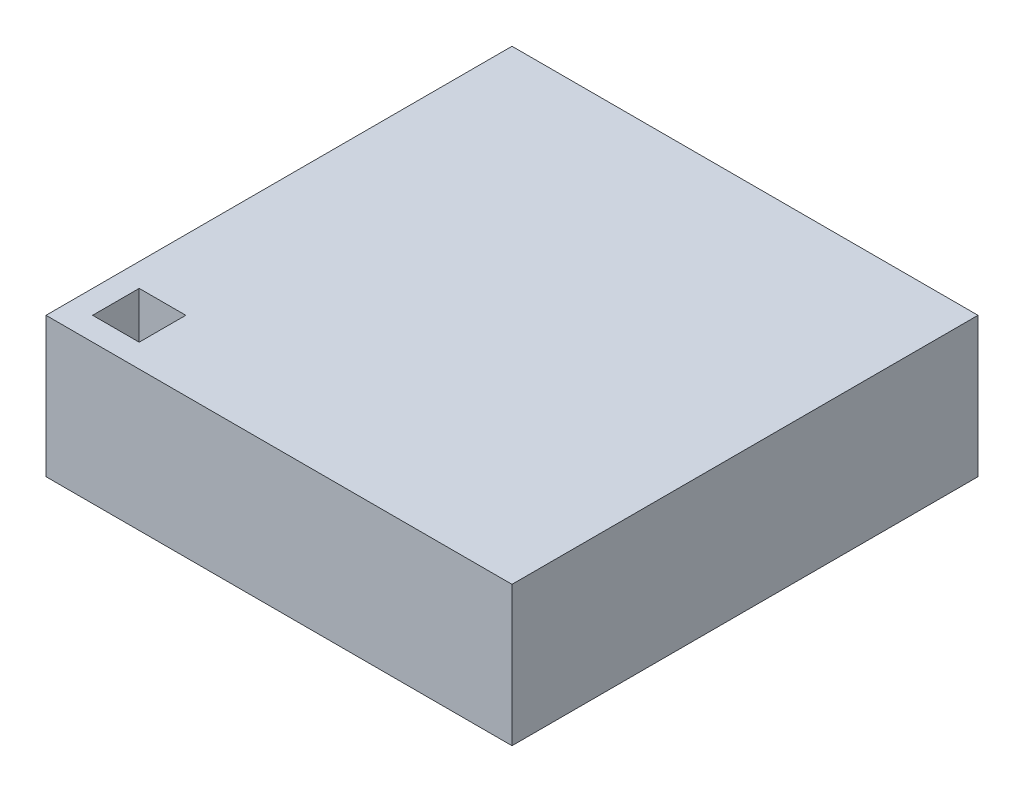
ISO-10303-21;
HEADER;
FILE_DESCRIPTION(('STEP AP214'),'2;1');
FILE_NAME('part.step','',(''),(''),'','','');
FILE_SCHEMA(('AUTOMOTIVE_DESIGN { 1 0 10303 214 1 1 1 1 }'));
ENDSEC;
DATA;
#1=APPLICATION_CONTEXT('core data for automotive mechanical design processes');
#2=APPLICATION_PROTOCOL_DEFINITION('international standard','automotive_design',2000,#1);
#3=PRODUCT_CONTEXT('',#1,'mechanical');
#4=PRODUCT('Part','Part','',(#3));
#5=PRODUCT_RELATED_PRODUCT_CATEGORY('part','',(#4));
#6=PRODUCT_DEFINITION_FORMATION('','',#4);
#7=PRODUCT_DEFINITION_CONTEXT('part definition',#1,'design');
#8=PRODUCT_DEFINITION('design','',#6,#7);
#9=PRODUCT_DEFINITION_SHAPE('','',#8);
#10=(LENGTH_UNIT() NAMED_UNIT(*) SI_UNIT(.MILLI.,.METRE.));
#11=(NAMED_UNIT(*) PLANE_ANGLE_UNIT() SI_UNIT($,.RADIAN.));
#12=(NAMED_UNIT(*) SI_UNIT($,.STERADIAN.) SOLID_ANGLE_UNIT());
#13=UNCERTAINTY_MEASURE_WITH_UNIT(LENGTH_MEASURE(1.E-05),#10,'distance_accuracy_value','');
#14=(GEOMETRIC_REPRESENTATION_CONTEXT(3) GLOBAL_UNCERTAINTY_ASSIGNED_CONTEXT((#13)) GLOBAL_UNIT_ASSIGNED_CONTEXT((#10,
#11,#12)) REPRESENTATION_CONTEXT('',''));
#15=CARTESIAN_POINT('',(0.,0.,0.));
#16=DIRECTION('',(0.,0.,1.));
#17=DIRECTION('',(1.,0.,0.));
#18=AXIS2_PLACEMENT_3D('',#15,#16,#17);
#19=CARTESIAN_POINT('',(-50.,30.,-50.));
#20=DIRECTION('',(1.,0.,0.));
#21=DIRECTION('',(0.,0.,-1.));
#22=AXIS2_PLACEMENT_3D('',#19,#20,#21);
#23=PLANE('',#22);
#24=DIRECTION('',(0.,0.,1.));
#25=VECTOR('',#24,1.);
#26=CARTESIAN_POINT('',(-50.,0.,-50.));
#27=LINE('',#26,#25);
#28=CARTESIAN_POINT('',(-50.,0.,-50.));
#29=VERTEX_POINT('',#28);
#30=CARTESIAN_POINT('',(-50.,0.,50.));
#31=VERTEX_POINT('',#30);
#32=EDGE_CURVE('E129',#29,#31,#27,.T.);
#33=ORIENTED_EDGE('',*,*,#32,.T.);
#34=DIRECTION('',(0.,-1.,0.));
#35=VECTOR('',#34,1.);
#36=CARTESIAN_POINT('',(-50.,30.,50.));
#37=LINE('',#36,#35);
#38=CARTESIAN_POINT('',(-50.,30.,50.));
#39=VERTEX_POINT('',#38);
#40=EDGE_CURVE('E11',#39,#31,#37,.T.);
#41=ORIENTED_EDGE('',*,*,#40,.F.);
#42=DIRECTION('',(0.,0.,1.));
#43=VECTOR('',#42,1.);
#44=CARTESIAN_POINT('',(-50.,30.,-50.));
#45=LINE('',#44,#43);
#46=CARTESIAN_POINT('',(-50.,30.,-50.));
#47=VERTEX_POINT('',#46);
#48=EDGE_CURVE('E141',#47,#39,#45,.T.);
#49=ORIENTED_EDGE('',*,*,#48,.F.);
#50=DIRECTION('',(0.,-1.,0.));
#51=VECTOR('',#50,1.);
#52=CARTESIAN_POINT('',(-50.,30.,-50.));
#53=LINE('',#52,#51);
#54=EDGE_CURVE('E150',#47,#29,#53,.T.);
#55=ORIENTED_EDGE('',*,*,#54,.T.);
#56=EDGE_LOOP('',(#33,#41,#49,#55));
#57=FACE_BOUND('',#56,.T.);
#58=ADVANCED_FACE('F32',(#57),#23,.F.);
#59=CARTESIAN_POINT('',(-50.,30.,50.));
#60=DIRECTION('',(0.,0.,-1.));
#61=DIRECTION('',(-1.,0.,0.));
#62=AXIS2_PLACEMENT_3D('',#59,#60,#61);
#63=PLANE('',#62);
#64=DIRECTION('',(1.,0.,0.));
#65=VECTOR('',#64,1.);
#66=CARTESIAN_POINT('',(-50.,0.,50.));
#67=LINE('',#66,#65);
#68=CARTESIAN_POINT('',(50.,0.,50.));
#69=VERTEX_POINT('',#68);
#70=EDGE_CURVE('E135',#31,#69,#67,.T.);
#71=ORIENTED_EDGE('',*,*,#70,.T.);
#72=DIRECTION('',(0.,-1.,0.));
#73=VECTOR('',#72,1.);
#74=CARTESIAN_POINT('',(50.,30.,50.));
#75=LINE('',#74,#73);
#76=CARTESIAN_POINT('',(50.,30.,50.));
#77=VERTEX_POINT('',#76);
#78=EDGE_CURVE('E39',#77,#69,#75,.T.);
#79=ORIENTED_EDGE('',*,*,#78,.F.);
#80=DIRECTION('',(1.,0.,0.));
#81=VECTOR('',#80,1.);
#82=CARTESIAN_POINT('',(-50.,30.,50.));
#83=LINE('',#82,#81);
#84=EDGE_CURVE('E144',#39,#77,#83,.T.);
#85=ORIENTED_EDGE('',*,*,#84,.F.);
#86=ORIENTED_EDGE('',*,*,#40,.T.);
#87=EDGE_LOOP('',(#71,#79,#85,#86));
#88=FACE_BOUND('',#87,.T.);
#89=ADVANCED_FACE('F174',(#88),#63,.F.);
#90=CARTESIAN_POINT('',(50.,30.,-50.));
#91=DIRECTION('',(-1.,0.,0.));
#92=DIRECTION('',(0.,0.,1.));
#93=AXIS2_PLACEMENT_3D('',#90,#91,#92);
#94=PLANE('',#93);
#95=DIRECTION('',(0.,0.,-1.));
#96=VECTOR('',#95,1.);
#97=CARTESIAN_POINT('',(50.,0.,-50.));
#98=LINE('',#97,#96);
#99=CARTESIAN_POINT('',(50.,0.,-50.));
#100=VERTEX_POINT('',#99);
#101=EDGE_CURVE('E137',#69,#100,#98,.T.);
#102=ORIENTED_EDGE('',*,*,#101,.T.);
#103=DIRECTION('',(0.,-1.,0.));
#104=VECTOR('',#103,1.);
#105=CARTESIAN_POINT('',(50.,30.,-50.));
#106=LINE('',#105,#104);
#107=CARTESIAN_POINT('',(50.,30.,-50.));
#108=VERTEX_POINT('',#107);
#109=EDGE_CURVE('E153',#108,#100,#106,.T.);
#110=ORIENTED_EDGE('',*,*,#109,.F.);
#111=DIRECTION('',(0.,0.,-1.));
#112=VECTOR('',#111,1.);
#113=CARTESIAN_POINT('',(50.,30.,-50.));
#114=LINE('',#113,#112);
#115=EDGE_CURVE('E146',#77,#108,#114,.T.);
#116=ORIENTED_EDGE('',*,*,#115,.F.);
#117=ORIENTED_EDGE('',*,*,#78,.T.);
#118=EDGE_LOOP('',(#102,#110,#116,#117));
#119=FACE_BOUND('',#118,.T.);
#120=ADVANCED_FACE('F160',(#119),#94,.F.);
#121=CARTESIAN_POINT('',(-50.,30.,-50.));
#122=DIRECTION('',(0.,0.,1.));
#123=DIRECTION('',(1.,0.,0.));
#124=AXIS2_PLACEMENT_3D('',#121,#122,#123);
#125=PLANE('',#124);
#126=DIRECTION('',(-1.,0.,0.));
#127=VECTOR('',#126,1.);
#128=CARTESIAN_POINT('',(-50.,0.,-50.));
#129=LINE('',#128,#127);
#130=EDGE_CURVE('E139',#100,#29,#129,.T.);
#131=ORIENTED_EDGE('',*,*,#130,.T.);
#132=ORIENTED_EDGE('',*,*,#54,.F.);
#133=DIRECTION('',(-1.,0.,0.));
#134=VECTOR('',#133,1.);
#135=CARTESIAN_POINT('',(-50.,30.,-50.));
#136=LINE('',#135,#134);
#137=EDGE_CURVE('E148',#108,#47,#136,.T.);
#138=ORIENTED_EDGE('',*,*,#137,.F.);
#139=ORIENTED_EDGE('',*,*,#109,.T.);
#140=EDGE_LOOP('',(#131,#132,#138,#139));
#141=FACE_BOUND('',#140,.T.);
#142=ADVANCED_FACE('F167',(#141),#125,.F.);
#143=CARTESIAN_POINT('',(-50.,30.,50.));
#144=DIRECTION('',(0.,1.,0.));
#145=DIRECTION('',(0.,0.,1.));
#146=AXIS2_PLACEMENT_3D('',#143,#144,#145);
#147=PLANE('',#146);
#148=DIRECTION('',(0.,0.,1.));
#149=VECTOR('',#148,1.);
#150=CARTESIAN_POINT('',(-45.,30.,45.));
#151=LINE('',#150,#149);
#152=CARTESIAN_POINT('',(-45.,30.,35.));
#153=VERTEX_POINT('',#152);
#154=CARTESIAN_POINT('',(-45.,30.,45.));
#155=VERTEX_POINT('',#154);
#156=EDGE_CURVE('E46',#153,#155,#151,.T.);
#157=ORIENTED_EDGE('',*,*,#156,.F.);
#158=DIRECTION('',(-1.,0.,0.));
#159=VECTOR('',#158,1.);
#160=CARTESIAN_POINT('',(-45.,30.,35.));
#161=LINE('',#160,#159);
#162=CARTESIAN_POINT('',(-35.,30.,35.));
#163=VERTEX_POINT('',#162);
#164=EDGE_CURVE('E114',#163,#153,#161,.T.);
#165=ORIENTED_EDGE('',*,*,#164,.F.);
#166=DIRECTION('',(0.,0.,-1.));
#167=VECTOR('',#166,1.);
#168=CARTESIAN_POINT('',(-35.,30.,45.));
#169=LINE('',#168,#167);
#170=CARTESIAN_POINT('',(-35.,30.,45.));
#171=VERTEX_POINT('',#170);
#172=EDGE_CURVE('E117',#171,#163,#169,.T.);
#173=ORIENTED_EDGE('',*,*,#172,.F.);
#174=DIRECTION('',(1.,0.,0.));
#175=VECTOR('',#174,1.);
#176=CARTESIAN_POINT('',(-45.,30.,45.));
#177=LINE('',#176,#175);
#178=EDGE_CURVE('E123',#155,#171,#177,.T.);
#179=ORIENTED_EDGE('',*,*,#178,.F.);
#180=EDGE_LOOP('',(#157,#165,#173,#179));
#181=FACE_BOUND('',#180,.T.);
#182=ORIENTED_EDGE('',*,*,#48,.T.);
#183=ORIENTED_EDGE('',*,*,#84,.T.);
#184=ORIENTED_EDGE('',*,*,#115,.T.);
#185=ORIENTED_EDGE('',*,*,#137,.T.);
#186=EDGE_LOOP('',(#182,#183,#184,#185));
#187=FACE_BOUND('',#186,.T.);
#188=ADVANCED_FACE('F173',(#181,#187),#147,.T.);
#189=CARTESIAN_POINT('',(-50.,0.,50.));
#190=DIRECTION('',(0.,1.,0.));
#191=DIRECTION('',(0.,0.,1.));
#192=AXIS2_PLACEMENT_3D('',#189,#190,#191);
#193=PLANE('',#192);
#194=DIRECTION('',(-1.,0.,0.));
#195=VECTOR('',#194,1.);
#196=CARTESIAN_POINT('',(-45.,0.,35.));
#197=LINE('',#196,#195);
#198=CARTESIAN_POINT('',(-35.,0.,35.));
#199=VERTEX_POINT('',#198);
#200=CARTESIAN_POINT('',(-45.,0.,35.));
#201=VERTEX_POINT('',#200);
#202=EDGE_CURVE('E104',#199,#201,#197,.T.);
#203=ORIENTED_EDGE('',*,*,#202,.T.);
#204=DIRECTION('',(0.,0.,1.));
#205=VECTOR('',#204,1.);
#206=CARTESIAN_POINT('',(-45.,0.,45.));
#207=LINE('',#206,#205);
#208=CARTESIAN_POINT('',(-45.,0.,45.));
#209=VERTEX_POINT('',#208);
#210=EDGE_CURVE('E98',#201,#209,#207,.T.);
#211=ORIENTED_EDGE('',*,*,#210,.T.);
#212=DIRECTION('',(1.,0.,0.));
#213=VECTOR('',#212,1.);
#214=CARTESIAN_POINT('',(-45.,0.,45.));
#215=LINE('',#214,#213);
#216=CARTESIAN_POINT('',(-35.,0.,45.));
#217=VERTEX_POINT('',#216);
#218=EDGE_CURVE('E107',#209,#217,#215,.T.);
#219=ORIENTED_EDGE('',*,*,#218,.T.);
#220=DIRECTION('',(0.,0.,-1.));
#221=VECTOR('',#220,1.);
#222=CARTESIAN_POINT('',(-35.,0.,45.));
#223=LINE('',#222,#221);
#224=EDGE_CURVE('E54',#217,#199,#223,.T.);
#225=ORIENTED_EDGE('',*,*,#224,.T.);
#226=EDGE_LOOP('',(#203,#211,#219,#225));
#227=FACE_BOUND('',#226,.T.);
#228=ORIENTED_EDGE('',*,*,#32,.F.);
#229=ORIENTED_EDGE('',*,*,#130,.F.);
#230=ORIENTED_EDGE('',*,*,#101,.F.);
#231=ORIENTED_EDGE('',*,*,#70,.F.);
#232=EDGE_LOOP('',(#228,#229,#230,#231));
#233=FACE_BOUND('',#232,.T.);
#234=ADVANCED_FACE('F111',(#227,#233),#193,.F.);
#235=CARTESIAN_POINT('',(-45.,0.,45.));
#236=DIRECTION('',(-1.,0.,0.));
#237=DIRECTION('',(0.,0.,1.));
#238=AXIS2_PLACEMENT_3D('',#235,#236,#237);
#239=PLANE('',#238);
#240=ORIENTED_EDGE('',*,*,#156,.T.);
#241=DIRECTION('',(0.,1.,0.));
#242=VECTOR('',#241,1.);
#243=CARTESIAN_POINT('',(-45.,0.,45.));
#244=LINE('',#243,#242);
#245=EDGE_CURVE('E94',#209,#155,#244,.T.);
#246=ORIENTED_EDGE('',*,*,#245,.F.);
#247=ORIENTED_EDGE('',*,*,#210,.F.);
#248=DIRECTION('',(0.,1.,0.));
#249=VECTOR('',#248,1.);
#250=CARTESIAN_POINT('',(-45.,0.,35.));
#251=LINE('',#250,#249);
#252=EDGE_CURVE('E127',#201,#153,#251,.T.);
#253=ORIENTED_EDGE('',*,*,#252,.T.);
#254=EDGE_LOOP('',(#240,#246,#247,#253));
#255=FACE_BOUND('',#254,.T.);
#256=ADVANCED_FACE('F96',(#255),#239,.F.);
#257=CARTESIAN_POINT('',(-45.,0.,35.));
#258=DIRECTION('',(0.,0.,-1.));
#259=DIRECTION('',(-1.,0.,0.));
#260=AXIS2_PLACEMENT_3D('',#257,#258,#259);
#261=PLANE('',#260);
#262=ORIENTED_EDGE('',*,*,#164,.T.);
#263=ORIENTED_EDGE('',*,*,#252,.F.);
#264=ORIENTED_EDGE('',*,*,#202,.F.);
#265=DIRECTION('',(0.,1.,0.));
#266=VECTOR('',#265,1.);
#267=CARTESIAN_POINT('',(-35.,0.,35.));
#268=LINE('',#267,#266);
#269=EDGE_CURVE('E130',#199,#163,#268,.T.);
#270=ORIENTED_EDGE('',*,*,#269,.T.);
#271=EDGE_LOOP('',(#262,#263,#264,#270));
#272=FACE_BOUND('',#271,.T.);
#273=ADVANCED_FACE('F191',(#272),#261,.F.);
#274=CARTESIAN_POINT('',(-35.,0.,45.));
#275=DIRECTION('',(1.,0.,0.));
#276=DIRECTION('',(0.,0.,-1.));
#277=AXIS2_PLACEMENT_3D('',#274,#275,#276);
#278=PLANE('',#277);
#279=ORIENTED_EDGE('',*,*,#172,.T.);
#280=ORIENTED_EDGE('',*,*,#269,.F.);
#281=ORIENTED_EDGE('',*,*,#224,.F.);
#282=DIRECTION('',(0.,1.,0.));
#283=VECTOR('',#282,1.);
#284=CARTESIAN_POINT('',(-35.,0.,45.));
#285=LINE('',#284,#283);
#286=EDGE_CURVE('E103',#217,#171,#285,.T.);
#287=ORIENTED_EDGE('',*,*,#286,.T.);
#288=EDGE_LOOP('',(#279,#280,#281,#287));
#289=FACE_BOUND('',#288,.T.);
#290=ADVANCED_FACE('F194',(#289),#278,.F.);
#291=CARTESIAN_POINT('',(-45.,0.,45.));
#292=DIRECTION('',(0.,0.,1.));
#293=DIRECTION('',(1.,0.,0.));
#294=AXIS2_PLACEMENT_3D('',#291,#292,#293);
#295=PLANE('',#294);
#296=ORIENTED_EDGE('',*,*,#178,.T.);
#297=ORIENTED_EDGE('',*,*,#286,.F.);
#298=ORIENTED_EDGE('',*,*,#218,.F.);
#299=ORIENTED_EDGE('',*,*,#245,.T.);
#300=EDGE_LOOP('',(#296,#297,#298,#299));
#301=FACE_BOUND('',#300,.T.);
#302=ADVANCED_FACE('F108',(#301),#295,.F.);
#303=CLOSED_SHELL('',(#58,#89,#120,#142,#188,#234,#256,#273,#290,#302));
#304=MANIFOLD_SOLID_BREP('B2',#303);
#305=ADVANCED_BREP_SHAPE_REPRESENTATION('',(#18,#304),#14);
#306=SHAPE_DEFINITION_REPRESENTATION(#9,#305);
ENDSEC;
END-ISO-10303-21;
